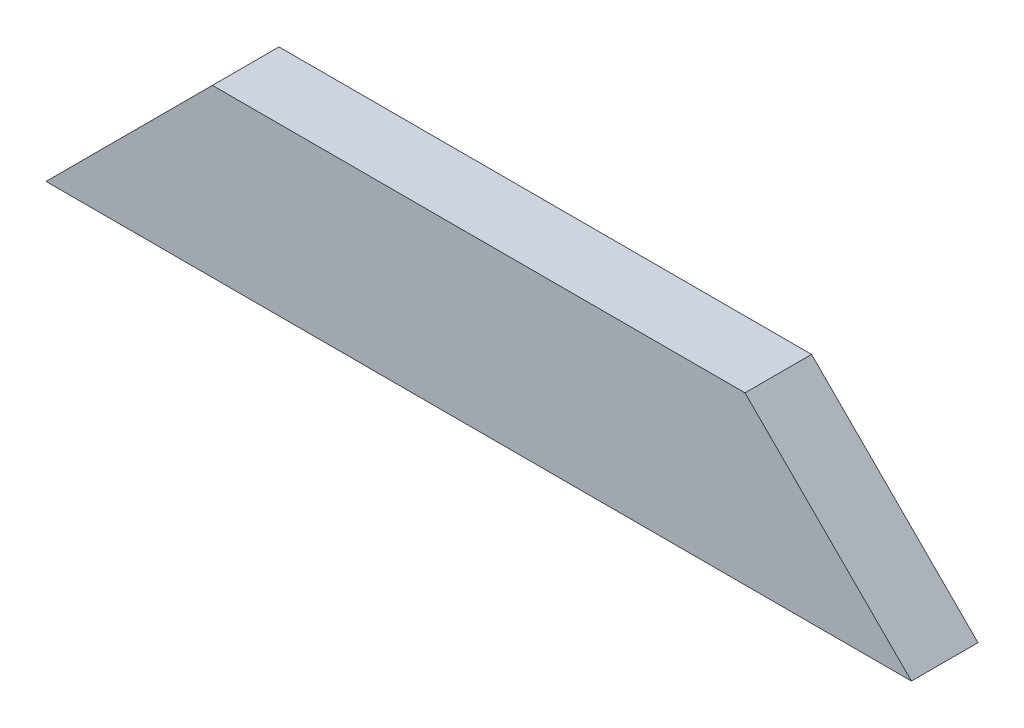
from build123d import *

# Parameters (mm, degrees)
BOSS_EXTRUDE1_DEPTH = 10


with BuildPart() as part:
    # Sketch1 → Boss-Extrude1 (new body)
    with BuildSketch(Plane.XY):
        Polygon((65, 0), (-65, 0), (-40, 25), (40, 25), align=None)
    extrude(amount=-BOSS_EXTRUDE1_DEPTH)


solid = part.part
